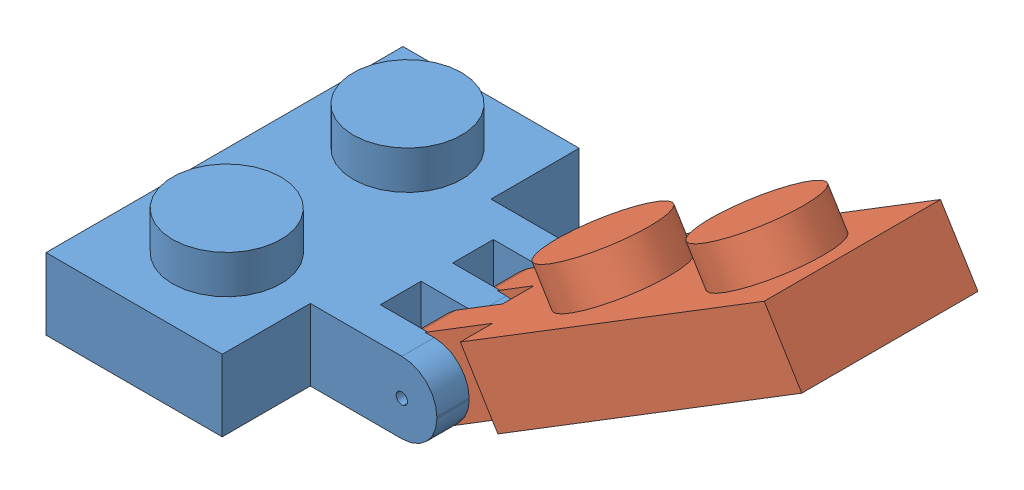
SolidWorks assembly Assem1.sldasm, configuration Default (file format 4400). Lengths in mm.
Overall size (29.55 15.37 15.8).
2 component instances, 2 part files, 2 mates.
Components (placement in the parent):
- Part0L2Blauw scharnier-1: Part0L2Blauw scharnier.SLDPRT [Default] at origin size (13.4 4.87 15.8)
- Part0L2BlauwB-1: Part0L2BlauwB.SLDPRT [Default] at (16.1013 2.3136 -11.7) x (0 0 1) z (-0.851372 -0.524562 0) size (7.8 4.87 21.4)
Mates (geometry in assembly coordinates):
- Coincident1: coincident aligned: plane of Part0L2Blauw scharnier-1 through (13.4 3.166 -3.9) normal (0 0 1); plane of Part0L2BlauwB-1 through (14.4406 5.009 -3.9) normal (0 0 1)
- Concentric1: concentric anti-aligned: cylinder of Part0L2Blauw scharnier-1 through (11.85 1.55 -15.8) axis (0 0 1) radius 0.25; cylinder of Part0L2BlauwB-1 through (11.85 1.55 -3.9) axis (0 0 -1) radius 0.25
